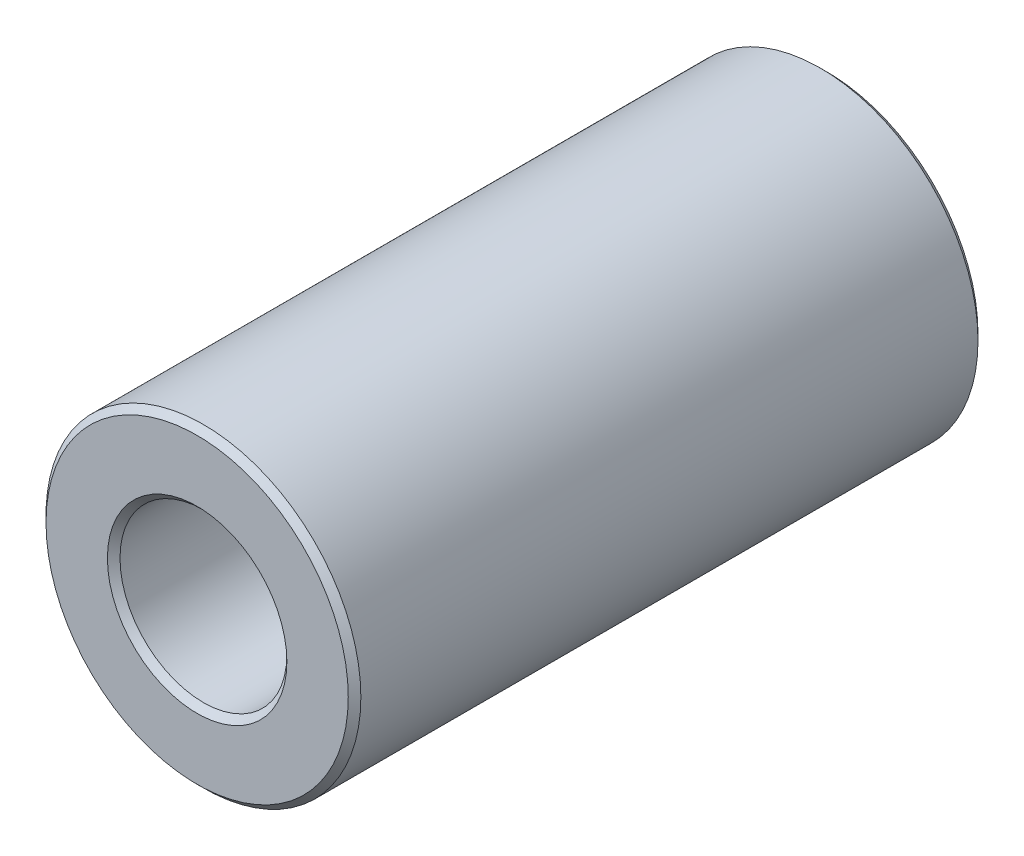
ISO-10303-21;
HEADER;
FILE_DESCRIPTION(('STEP AP214'),'2;1');
FILE_NAME('part.step','',(''),(''),'','','');
FILE_SCHEMA(('AUTOMOTIVE_DESIGN { 1 0 10303 214 1 1 1 1 }'));
ENDSEC;
DATA;
#1=APPLICATION_CONTEXT('core data for automotive mechanical design processes');
#2=APPLICATION_PROTOCOL_DEFINITION('international standard','automotive_design',2000,#1);
#3=PRODUCT_CONTEXT('',#1,'mechanical');
#4=PRODUCT('Part','Part','',(#3));
#5=PRODUCT_RELATED_PRODUCT_CATEGORY('part','',(#4));
#6=PRODUCT_DEFINITION_FORMATION('','',#4);
#7=PRODUCT_DEFINITION_CONTEXT('part definition',#1,'design');
#8=PRODUCT_DEFINITION('design','',#6,#7);
#9=PRODUCT_DEFINITION_SHAPE('','',#8);
#10=(LENGTH_UNIT() NAMED_UNIT(*) SI_UNIT(.MILLI.,.METRE.));
#11=(NAMED_UNIT(*) PLANE_ANGLE_UNIT() SI_UNIT($,.RADIAN.));
#12=(NAMED_UNIT(*) SI_UNIT($,.STERADIAN.) SOLID_ANGLE_UNIT());
#13=UNCERTAINTY_MEASURE_WITH_UNIT(LENGTH_MEASURE(1.E-05),#10,'distance_accuracy_value','');
#14=(GEOMETRIC_REPRESENTATION_CONTEXT(3) GLOBAL_UNCERTAINTY_ASSIGNED_CONTEXT((#13)) GLOBAL_UNIT_ASSIGNED_CONTEXT((#10,
#11,#12)) REPRESENTATION_CONTEXT('',''));
#15=CARTESIAN_POINT('',(0.,0.,0.));
#16=DIRECTION('',(0.,0.,1.));
#17=DIRECTION('',(1.,0.,0.));
#18=AXIS2_PLACEMENT_3D('',#15,#16,#17);
#19=CARTESIAN_POINT('',(0.,0.,10.));
#20=DIRECTION('',(0.,0.,1.));
#21=DIRECTION('',(1.,0.,0.));
#22=AXIS2_PLACEMENT_3D('',#19,#20,#21);
#23=PLANE('',#22);
#24=CARTESIAN_POINT('',(0.,0.,10.));
#25=DIRECTION('',(0.,0.,1.));
#26=DIRECTION('',(1.,0.,0.));
#27=AXIS2_PLACEMENT_3D('',#24,#25,#26);
#28=CIRCLE('',#27,2.85);
#29=CARTESIAN_POINT('',(2.85,0.,10.));
#30=VERTEX_POINT('',#29);
#31=EDGE_CURVE('E10',#30,#30,#28,.F.);
#32=ORIENTED_EDGE('',*,*,#31,.T.);
#33=EDGE_LOOP('',(#32));
#34=FACE_BOUND('',#33,.T.);
#35=CARTESIAN_POINT('',(0.,0.,10.));
#36=DIRECTION('',(0.,0.,1.));
#37=DIRECTION('',(1.,0.,0.));
#38=AXIS2_PLACEMENT_3D('',#35,#36,#37);
#39=CIRCLE('',#38,4.8);
#40=CARTESIAN_POINT('',(4.8,0.,10.));
#41=VERTEX_POINT('',#40);
#42=EDGE_CURVE('E45',#41,#41,#39,.T.);
#43=ORIENTED_EDGE('',*,*,#42,.T.);
#44=EDGE_LOOP('',(#43));
#45=FACE_BOUND('',#44,.T.);
#46=ADVANCED_FACE('F37',(#34,#45),#23,.T.);
#47=CARTESIAN_POINT('',(0.,0.,-10.));
#48=DIRECTION('',(0.,0.,1.));
#49=DIRECTION('',(1.,0.,0.));
#50=AXIS2_PLACEMENT_3D('',#47,#48,#49);
#51=PLANE('',#50);
#52=CARTESIAN_POINT('',(0.,0.,-10.));
#53=DIRECTION('',(0.,0.,1.));
#54=DIRECTION('',(1.,0.,0.));
#55=AXIS2_PLACEMENT_3D('',#52,#53,#54);
#56=CIRCLE('',#55,4.8);
#57=CARTESIAN_POINT('',(4.8,0.,-10.));
#58=VERTEX_POINT('',#57);
#59=EDGE_CURVE('E62',#58,#58,#56,.F.);
#60=ORIENTED_EDGE('',*,*,#59,.T.);
#61=EDGE_LOOP('',(#60));
#62=FACE_BOUND('',#61,.T.);
#63=CARTESIAN_POINT('',(0.,0.,-10.));
#64=DIRECTION('',(0.,0.,1.));
#65=DIRECTION('',(1.,0.,0.));
#66=AXIS2_PLACEMENT_3D('',#63,#64,#65);
#67=CIRCLE('',#66,2.85);
#68=CARTESIAN_POINT('',(2.85,0.,-10.));
#69=VERTEX_POINT('',#68);
#70=EDGE_CURVE('E65',#69,#69,#67,.T.);
#71=ORIENTED_EDGE('',*,*,#70,.T.);
#72=EDGE_LOOP('',(#71));
#73=FACE_BOUND('',#72,.T.);
#74=ADVANCED_FACE('F89',(#62,#73),#51,.F.);
#75=CARTESIAN_POINT('',(0.,0.,10.));
#76=DIRECTION('',(0.,0.,-1.));
#77=DIRECTION('',(-1.,0.,0.));
#78=AXIS2_PLACEMENT_3D('',#75,#76,#77);
#79=CYLINDRICAL_SURFACE('',#78,5.);
#80=CARTESIAN_POINT('',(0.,0.,-9.8));
#81=DIRECTION('',(0.,0.,1.));
#82=DIRECTION('',(1.,0.,0.));
#83=AXIS2_PLACEMENT_3D('',#80,#81,#82);
#84=CIRCLE('',#83,5.);
#85=CARTESIAN_POINT('',(5.,0.,-9.8));
#86=VERTEX_POINT('',#85);
#87=EDGE_CURVE('E69',#86,#86,#84,.T.);
#88=ORIENTED_EDGE('',*,*,#87,.T.);
#89=EDGE_LOOP('',(#88));
#90=FACE_BOUND('',#89,.T.);
#91=CARTESIAN_POINT('',(0.,0.,9.8));
#92=DIRECTION('',(0.,0.,1.));
#93=DIRECTION('',(1.,0.,0.));
#94=AXIS2_PLACEMENT_3D('',#91,#92,#93);
#95=CIRCLE('',#94,5.);
#96=CARTESIAN_POINT('',(5.,0.,9.8));
#97=VERTEX_POINT('',#96);
#98=EDGE_CURVE('E73',#97,#97,#95,.F.);
#99=ORIENTED_EDGE('',*,*,#98,.T.);
#100=EDGE_LOOP('',(#99));
#101=FACE_BOUND('',#100,.T.);
#102=ADVANCED_FACE('F78',(#90,#101),#79,.T.);
#103=CARTESIAN_POINT('',(0.,0.,10.));
#104=DIRECTION('',(0.,0.,-1.));
#105=DIRECTION('',(-1.,0.,0.));
#106=AXIS2_PLACEMENT_3D('',#103,#104,#105);
#107=CYLINDRICAL_SURFACE('',#106,2.65);
#108=CARTESIAN_POINT('',(0.,0.,-9.8));
#109=DIRECTION('',(0.,0.,1.));
#110=DIRECTION('',(1.,0.,0.));
#111=AXIS2_PLACEMENT_3D('',#108,#109,#110);
#112=CIRCLE('',#111,2.65);
#113=CARTESIAN_POINT('',(2.65,0.,-9.8));
#114=VERTEX_POINT('',#113);
#115=EDGE_CURVE('E52',#114,#114,#112,.F.);
#116=ORIENTED_EDGE('',*,*,#115,.T.);
#117=EDGE_LOOP('',(#116));
#118=FACE_BOUND('',#117,.T.);
#119=CARTESIAN_POINT('',(0.,0.,9.8));
#120=DIRECTION('',(0.,0.,1.));
#121=DIRECTION('',(1.,0.,0.));
#122=AXIS2_PLACEMENT_3D('',#119,#120,#121);
#123=CIRCLE('',#122,2.65);
#124=CARTESIAN_POINT('',(2.65,0.,9.8));
#125=VERTEX_POINT('',#124);
#126=EDGE_CURVE('E57',#125,#125,#123,.T.);
#127=ORIENTED_EDGE('',*,*,#126,.T.);
#128=EDGE_LOOP('',(#127));
#129=FACE_BOUND('',#128,.T.);
#130=ADVANCED_FACE('F97',(#118,#129),#107,.F.);
#131=CARTESIAN_POINT('',(0.,0.,-9.8));
#132=DIRECTION('',(0.,0.,1.));
#133=DIRECTION('',(1.,0.,0.));
#134=AXIS2_PLACEMENT_3D('',#131,#132,#133);
#135=CONICAL_SURFACE('',#134,5.,0.78539816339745);
#136=ORIENTED_EDGE('',*,*,#59,.F.);
#137=EDGE_LOOP('',(#136));
#138=FACE_BOUND('',#137,.T.);
#139=ORIENTED_EDGE('',*,*,#87,.F.);
#140=EDGE_LOOP('',(#139));
#141=FACE_BOUND('',#140,.T.);
#142=ADVANCED_FACE('F102',(#138,#141),#135,.T.);
#143=CARTESIAN_POINT('',(0.,0.,-10.));
#144=DIRECTION('',(0.,0.,-1.));
#145=DIRECTION('',(-1.,0.,0.));
#146=AXIS2_PLACEMENT_3D('',#143,#144,#145);
#147=CONICAL_SURFACE('',#146,2.85,0.785398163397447);
#148=ORIENTED_EDGE('',*,*,#115,.F.);
#149=EDGE_LOOP('',(#148));
#150=FACE_BOUND('',#149,.T.);
#151=ORIENTED_EDGE('',*,*,#70,.F.);
#152=EDGE_LOOP('',(#151));
#153=FACE_BOUND('',#152,.T.);
#154=ADVANCED_FACE('F86',(#150,#153),#147,.F.);
#155=CARTESIAN_POINT('',(0.,0.,9.8));
#156=DIRECTION('',(0.,0.,1.));
#157=DIRECTION('',(1.,0.,0.));
#158=AXIS2_PLACEMENT_3D('',#155,#156,#157);
#159=CONICAL_SURFACE('',#158,2.65,0.785398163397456);
#160=ORIENTED_EDGE('',*,*,#31,.F.);
#161=EDGE_LOOP('',(#160));
#162=FACE_BOUND('',#161,.T.);
#163=ORIENTED_EDGE('',*,*,#126,.F.);
#164=EDGE_LOOP('',(#163));
#165=FACE_BOUND('',#164,.T.);
#166=ADVANCED_FACE('F82',(#162,#165),#159,.F.);
#167=CARTESIAN_POINT('',(0.,0.,10.));
#168=DIRECTION('',(0.,0.,-1.));
#169=DIRECTION('',(-1.,0.,0.));
#170=AXIS2_PLACEMENT_3D('',#167,#168,#169);
#171=CONICAL_SURFACE('',#170,4.8,0.78539816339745);
#172=ORIENTED_EDGE('',*,*,#98,.F.);
#173=EDGE_LOOP('',(#172));
#174=FACE_BOUND('',#173,.T.);
#175=ORIENTED_EDGE('',*,*,#42,.F.);
#176=EDGE_LOOP('',(#175));
#177=FACE_BOUND('',#176,.T.);
#178=ADVANCED_FACE('F39',(#174,#177),#171,.T.);
#179=CLOSED_SHELL('',(#46,#74,#102,#130,#142,#154,#166,#178));
#180=MANIFOLD_SOLID_BREP('B2',#179);
#181=ADVANCED_BREP_SHAPE_REPRESENTATION('',(#18,#180),#14);
#182=SHAPE_DEFINITION_REPRESENTATION(#9,#181);
ENDSEC;
END-ISO-10303-21;
